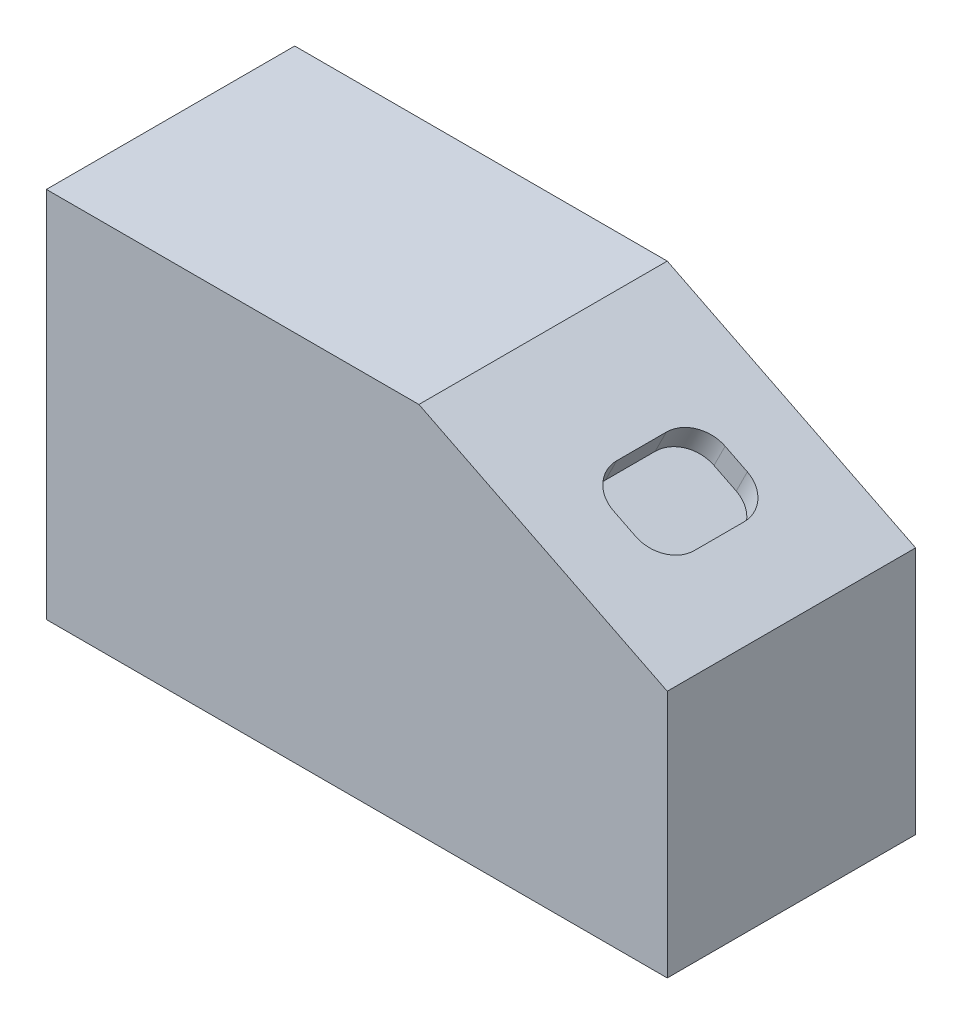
ISO-10303-21;
HEADER;
FILE_DESCRIPTION(('STEP AP214'),'2;1');
FILE_NAME('part.step','',(''),(''),'','','');
FILE_SCHEMA(('AUTOMOTIVE_DESIGN { 1 0 10303 214 1 1 1 1 }'));
ENDSEC;
DATA;
#1=APPLICATION_CONTEXT('core data for automotive mechanical design processes');
#2=APPLICATION_PROTOCOL_DEFINITION('international standard','automotive_design',2000,#1);
#3=PRODUCT_CONTEXT('',#1,'mechanical');
#4=PRODUCT('Part','Part','',(#3));
#5=PRODUCT_RELATED_PRODUCT_CATEGORY('part','',(#4));
#6=PRODUCT_DEFINITION_FORMATION('','',#4);
#7=PRODUCT_DEFINITION_CONTEXT('part definition',#1,'design');
#8=PRODUCT_DEFINITION('design','',#6,#7);
#9=PRODUCT_DEFINITION_SHAPE('','',#8);
#10=(LENGTH_UNIT() NAMED_UNIT(*) SI_UNIT(.MILLI.,.METRE.));
#11=(NAMED_UNIT(*) PLANE_ANGLE_UNIT() SI_UNIT($,.RADIAN.));
#12=(NAMED_UNIT(*) SI_UNIT($,.STERADIAN.) SOLID_ANGLE_UNIT());
#13=UNCERTAINTY_MEASURE_WITH_UNIT(LENGTH_MEASURE(1.E-05),#10,'distance_accuracy_value','');
#14=(GEOMETRIC_REPRESENTATION_CONTEXT(3) GLOBAL_UNCERTAINTY_ASSIGNED_CONTEXT((#13)) GLOBAL_UNIT_ASSIGNED_CONTEXT((#10,
#11,#12)) REPRESENTATION_CONTEXT('',''));
#15=CARTESIAN_POINT('',(0.,0.,0.));
#16=DIRECTION('',(0.,0.,1.));
#17=DIRECTION('',(1.,0.,0.));
#18=AXIS2_PLACEMENT_3D('',#15,#16,#17);
#19=CARTESIAN_POINT('',(0.,0.,-40.));
#20=DIRECTION('',(-1.,0.,0.));
#21=DIRECTION('',(0.,0.,1.));
#22=AXIS2_PLACEMENT_3D('',#19,#20,#21);
#23=PLANE('',#22);
#24=DIRECTION('',(0.,-1.,0.));
#25=VECTOR('',#24,1.);
#26=CARTESIAN_POINT('',(0.,0.,0.));
#27=LINE('',#26,#25);
#28=CARTESIAN_POINT('',(0.,60.,0.));
#29=VERTEX_POINT('',#28);
#30=CARTESIAN_POINT('',(0.,0.,0.));
#31=VERTEX_POINT('',#30);
#32=EDGE_CURVE('E161',#29,#31,#27,.T.);
#33=ORIENTED_EDGE('',*,*,#32,.F.);
#34=DIRECTION('',(0.,0.,1.));
#35=VECTOR('',#34,1.);
#36=CARTESIAN_POINT('',(0.,60.,-40.));
#37=LINE('',#36,#35);
#38=CARTESIAN_POINT('',(0.,60.,-40.));
#39=VERTEX_POINT('',#38);
#40=EDGE_CURVE('E171',#39,#29,#37,.T.);
#41=ORIENTED_EDGE('',*,*,#40,.F.);
#42=DIRECTION('',(0.,-1.,0.));
#43=VECTOR('',#42,1.);
#44=CARTESIAN_POINT('',(0.,0.,-40.));
#45=LINE('',#44,#43);
#46=CARTESIAN_POINT('',(0.,0.,-40.));
#47=VERTEX_POINT('',#46);
#48=EDGE_CURVE('E151',#39,#47,#45,.T.);
#49=ORIENTED_EDGE('',*,*,#48,.T.);
#50=DIRECTION('',(0.,0.,1.));
#51=VECTOR('',#50,1.);
#52=CARTESIAN_POINT('',(0.,0.,-40.));
#53=LINE('',#52,#51);
#54=EDGE_CURVE('E152',#47,#31,#53,.T.);
#55=ORIENTED_EDGE('',*,*,#54,.T.);
#56=EDGE_LOOP('',(#33,#41,#49,#55));
#57=FACE_BOUND('',#56,.T.);
#58=ADVANCED_FACE('F33',(#57),#23,.T.);
#59=CARTESIAN_POINT('',(0.,60.,-40.));
#60=DIRECTION('',(0.,1.,0.));
#61=DIRECTION('',(0.,0.,1.));
#62=AXIS2_PLACEMENT_3D('',#59,#60,#61);
#63=PLANE('',#62);
#64=DIRECTION('',(0.,0.,1.));
#65=VECTOR('',#64,1.);
#66=CARTESIAN_POINT('',(60.,60.,-40.));
#67=LINE('',#66,#65);
#68=CARTESIAN_POINT('',(60.,60.,-40.));
#69=VERTEX_POINT('',#68);
#70=CARTESIAN_POINT('',(60.,60.,0.));
#71=VERTEX_POINT('',#70);
#72=EDGE_CURVE('E129',#69,#71,#67,.T.);
#73=ORIENTED_EDGE('',*,*,#72,.F.);
#74=DIRECTION('',(-1.,0.,0.));
#75=VECTOR('',#74,1.);
#76=CARTESIAN_POINT('',(0.,60.,-40.));
#77=LINE('',#76,#75);
#78=EDGE_CURVE('E143',#69,#39,#77,.T.);
#79=ORIENTED_EDGE('',*,*,#78,.T.);
#80=ORIENTED_EDGE('',*,*,#40,.T.);
#81=DIRECTION('',(-1.,0.,0.));
#82=VECTOR('',#81,1.);
#83=CARTESIAN_POINT('',(0.,60.,0.));
#84=LINE('',#83,#82);
#85=EDGE_CURVE('E145',#71,#29,#84,.T.);
#86=ORIENTED_EDGE('',*,*,#85,.F.);
#87=EDGE_LOOP('',(#73,#79,#80,#86));
#88=FACE_BOUND('',#87,.T.);
#89=ADVANCED_FACE('F141',(#88),#63,.T.);
#90=CARTESIAN_POINT('',(100.,0.,-40.));
#91=DIRECTION('',(1.,0.,0.));
#92=DIRECTION('',(0.,0.,-1.));
#93=AXIS2_PLACEMENT_3D('',#90,#91,#92);
#94=PLANE('',#93);
#95=DIRECTION('',(0.,0.,1.));
#96=VECTOR('',#95,1.);
#97=CARTESIAN_POINT('',(100.,40.,-40.));
#98=LINE('',#97,#96);
#99=CARTESIAN_POINT('',(100.,40.,-40.));
#100=VERTEX_POINT('',#99);
#101=CARTESIAN_POINT('',(100.,40.,0.));
#102=VERTEX_POINT('',#101);
#103=EDGE_CURVE('E132',#100,#102,#98,.T.);
#104=ORIENTED_EDGE('',*,*,#103,.T.);
#105=DIRECTION('',(0.,1.,0.));
#106=VECTOR('',#105,1.);
#107=CARTESIAN_POINT('',(100.,0.,0.));
#108=LINE('',#107,#106);
#109=CARTESIAN_POINT('',(100.,0.,0.));
#110=VERTEX_POINT('',#109);
#111=EDGE_CURVE('E167',#110,#102,#108,.T.);
#112=ORIENTED_EDGE('',*,*,#111,.F.);
#113=DIRECTION('',(0.,0.,1.));
#114=VECTOR('',#113,1.);
#115=CARTESIAN_POINT('',(100.,0.,-40.));
#116=LINE('',#115,#114);
#117=CARTESIAN_POINT('',(100.,0.,-40.));
#118=VERTEX_POINT('',#117);
#119=EDGE_CURVE('E155',#118,#110,#116,.T.);
#120=ORIENTED_EDGE('',*,*,#119,.F.);
#121=DIRECTION('',(0.,1.,0.));
#122=VECTOR('',#121,1.);
#123=CARTESIAN_POINT('',(100.,0.,-40.));
#124=LINE('',#123,#122);
#125=EDGE_CURVE('E153',#118,#100,#124,.T.);
#126=ORIENTED_EDGE('',*,*,#125,.T.);
#127=EDGE_LOOP('',(#104,#112,#120,#126));
#128=FACE_BOUND('',#127,.T.);
#129=ADVANCED_FACE('F254',(#128),#94,.T.);
#130=CARTESIAN_POINT('',(0.,0.,-40.));
#131=DIRECTION('',(0.,-1.,0.));
#132=DIRECTION('',(0.,0.,-1.));
#133=AXIS2_PLACEMENT_3D('',#130,#131,#132);
#134=PLANE('',#133);
#135=DIRECTION('',(1.,0.,0.));
#136=VECTOR('',#135,1.);
#137=CARTESIAN_POINT('',(0.,0.,0.));
#138=LINE('',#137,#136);
#139=EDGE_CURVE('E164',#31,#110,#138,.T.);
#140=ORIENTED_EDGE('',*,*,#139,.F.);
#141=ORIENTED_EDGE('',*,*,#54,.F.);
#142=DIRECTION('',(1.,0.,0.));
#143=VECTOR('',#142,1.);
#144=CARTESIAN_POINT('',(0.,0.,-40.));
#145=LINE('',#144,#143);
#146=EDGE_CURVE('E157',#47,#118,#145,.T.);
#147=ORIENTED_EDGE('',*,*,#146,.T.);
#148=ORIENTED_EDGE('',*,*,#119,.T.);
#149=EDGE_LOOP('',(#140,#141,#147,#148));
#150=FACE_BOUND('',#149,.T.);
#151=ADVANCED_FACE('F247',(#150),#134,.T.);
#152=CARTESIAN_POINT('',(0.,0.,-40.));
#153=DIRECTION('',(0.,0.,-1.));
#154=DIRECTION('',(-1.,0.,0.));
#155=AXIS2_PLACEMENT_3D('',#152,#153,#154);
#156=PLANE('',#155);
#157=DIRECTION('',(0.894427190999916,-0.447213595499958,0.));
#158=VECTOR('',#157,1.);
#159=CARTESIAN_POINT('',(100.,40.,-40.));
#160=LINE('',#159,#158);
#161=EDGE_CURVE('E126',#69,#100,#160,.T.);
#162=ORIENTED_EDGE('',*,*,#161,.T.);
#163=ORIENTED_EDGE('',*,*,#125,.F.);
#164=ORIENTED_EDGE('',*,*,#146,.F.);
#165=ORIENTED_EDGE('',*,*,#48,.F.);
#166=ORIENTED_EDGE('',*,*,#78,.F.);
#167=EDGE_LOOP('',(#162,#163,#164,#165,#166));
#168=FACE_BOUND('',#167,.T.);
#169=ADVANCED_FACE('F148',(#168),#156,.T.);
#170=CARTESIAN_POINT('',(0.,0.,0.));
#171=DIRECTION('',(0.,0.,-1.));
#172=DIRECTION('',(-1.,0.,0.));
#173=AXIS2_PLACEMENT_3D('',#170,#171,#172);
#174=PLANE('',#173);
#175=ORIENTED_EDGE('',*,*,#111,.T.);
#176=DIRECTION('',(0.894427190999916,-0.447213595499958,0.));
#177=VECTOR('',#176,1.);
#178=CARTESIAN_POINT('',(100.,40.,0.));
#179=LINE('',#178,#177);
#180=EDGE_CURVE('E137',#71,#102,#179,.T.);
#181=ORIENTED_EDGE('',*,*,#180,.F.);
#182=ORIENTED_EDGE('',*,*,#85,.T.);
#183=ORIENTED_EDGE('',*,*,#32,.T.);
#184=ORIENTED_EDGE('',*,*,#139,.T.);
#185=EDGE_LOOP('',(#175,#181,#182,#183,#184));
#186=FACE_BOUND('',#185,.T.);
#187=ADVANCED_FACE('F252',(#186),#174,.F.);
#188=CARTESIAN_POINT('',(100.,40.,-40.));
#189=DIRECTION('',(-0.447213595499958,-0.894427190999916,0.));
#190=DIRECTION('',(0.894427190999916,-0.447213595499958,0.));
#191=AXIS2_PLACEMENT_3D('',#188,#189,#190);
#192=PLANE('',#191);
#193=DIRECTION('',(-0.894427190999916,0.447213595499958,0.));
#194=VECTOR('',#193,1.);
#195=CARTESIAN_POINT('',(75.8504658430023,52.0747670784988,-29.));
#196=LINE('',#195,#194);
#197=CARTESIAN_POINT('',(83.9003105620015,48.0498447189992,-29.));
#198=VERTEX_POINT('',#197);
#199=CARTESIAN_POINT('',(80.3226017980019,49.8386991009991,-29.));
#200=VERTEX_POINT('',#199);
#201=EDGE_CURVE('E207',#198,#200,#196,.T.);
#202=ORIENTED_EDGE('',*,*,#201,.F.);
#203=CARTESIAN_POINT('',(83.9003105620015,48.0498447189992,-24.));
#204=DIRECTION('',(-0.447213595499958,-0.894427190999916,0.));
#205=DIRECTION('',(0.894427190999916,-0.447213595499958,0.));
#206=AXIS2_PLACEMENT_3D('',#203,#204,#205);
#207=CIRCLE('',#206,5.);
#208=CARTESIAN_POINT('',(88.3724465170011,45.8137767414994,-24.));
#209=VERTEX_POINT('',#208);
#210=EDGE_CURVE('E41',#198,#209,#207,.T.);
#211=ORIENTED_EDGE('',*,*,#210,.T.);
#212=DIRECTION('',(0.,0.,-1.));
#213=VECTOR('',#212,1.);
#214=CARTESIAN_POINT('',(88.3724465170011,45.8137767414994,-11.));
#215=LINE('',#214,#213);
#216=CARTESIAN_POINT('',(88.3724465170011,45.8137767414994,-16.));
#217=VERTEX_POINT('',#216);
#218=EDGE_CURVE('E206',#217,#209,#215,.T.);
#219=ORIENTED_EDGE('',*,*,#218,.F.);
#220=CARTESIAN_POINT('',(83.9003105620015,48.0498447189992,-16.));
#221=DIRECTION('',(-0.447213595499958,-0.894427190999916,0.));
#222=DIRECTION('',(0.894427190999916,-0.447213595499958,0.));
#223=AXIS2_PLACEMENT_3D('',#220,#221,#222);
#224=CIRCLE('',#223,5.);
#225=CARTESIAN_POINT('',(83.9003105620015,48.0498447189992,-11.));
#226=VERTEX_POINT('',#225);
#227=EDGE_CURVE('E203',#217,#226,#224,.T.);
#228=ORIENTED_EDGE('',*,*,#227,.T.);
#229=DIRECTION('',(0.894427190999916,-0.447213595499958,0.));
#230=VECTOR('',#229,1.);
#231=CARTESIAN_POINT('',(75.8504658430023,52.0747670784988,-11.));
#232=LINE('',#231,#230);
#233=CARTESIAN_POINT('',(80.3226017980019,49.8386991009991,-11.));
#234=VERTEX_POINT('',#233);
#235=EDGE_CURVE('E231',#234,#226,#232,.T.);
#236=ORIENTED_EDGE('',*,*,#235,.F.);
#237=CARTESIAN_POINT('',(80.3226017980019,49.8386991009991,-16.));
#238=DIRECTION('',(-0.447213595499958,-0.894427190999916,0.));
#239=DIRECTION('',(0.894427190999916,-0.447213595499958,0.));
#240=AXIS2_PLACEMENT_3D('',#237,#238,#239);
#241=CIRCLE('',#240,5.);
#242=CARTESIAN_POINT('',(75.8504658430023,52.0747670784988,-16.));
#243=VERTEX_POINT('',#242);
#244=EDGE_CURVE('E201',#234,#243,#241,.T.);
#245=ORIENTED_EDGE('',*,*,#244,.T.);
#246=DIRECTION('',(0.,0.,1.));
#247=VECTOR('',#246,1.);
#248=CARTESIAN_POINT('',(75.8504658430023,52.0747670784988,-11.));
#249=LINE('',#248,#247);
#250=CARTESIAN_POINT('',(75.8504658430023,52.0747670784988,-24.));
#251=VERTEX_POINT('',#250);
#252=EDGE_CURVE('E237',#251,#243,#249,.T.);
#253=ORIENTED_EDGE('',*,*,#252,.F.);
#254=CARTESIAN_POINT('',(80.3226017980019,49.8386991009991,-24.));
#255=DIRECTION('',(-0.447213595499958,-0.894427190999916,0.));
#256=DIRECTION('',(0.894427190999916,-0.447213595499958,0.));
#257=AXIS2_PLACEMENT_3D('',#254,#255,#256);
#258=CIRCLE('',#257,5.);
#259=EDGE_CURVE('E11',#251,#200,#258,.T.);
#260=ORIENTED_EDGE('',*,*,#259,.T.);
#261=EDGE_LOOP('',(#202,#211,#219,#228,#236,#245,#253,#260));
#262=FACE_BOUND('',#261,.T.);
#263=ORIENTED_EDGE('',*,*,#180,.T.);
#264=ORIENTED_EDGE('',*,*,#103,.F.);
#265=ORIENTED_EDGE('',*,*,#161,.F.);
#266=ORIENTED_EDGE('',*,*,#72,.T.);
#267=EDGE_LOOP('',(#263,#264,#265,#266));
#268=FACE_BOUND('',#267,.T.);
#269=ADVANCED_FACE('F128',(#262,#268),#192,.F.);
#270=CARTESIAN_POINT('',(86.5835921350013,42.2360679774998,-11.));
#271=DIRECTION('',(0.894427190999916,-0.447213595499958,0.));
#272=DIRECTION('',(0.447213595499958,0.894427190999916,0.));
#273=AXIS2_PLACEMENT_3D('',#270,#271,#272);
#274=PLANE('',#273);
#275=DIRECTION('',(0.,0.,-1.));
#276=VECTOR('',#275,1.);
#277=CARTESIAN_POINT('',(86.5835921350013,42.2360679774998,-11.));
#278=LINE('',#277,#276);
#279=CARTESIAN_POINT('',(86.5835921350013,42.2360679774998,-16.));
#280=VERTEX_POINT('',#279);
#281=CARTESIAN_POINT('',(86.5835921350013,42.2360679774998,-24.));
#282=VERTEX_POINT('',#281);
#283=EDGE_CURVE('E223',#280,#282,#278,.T.);
#284=ORIENTED_EDGE('',*,*,#283,.F.);
#285=DIRECTION('',(0.447213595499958,0.894427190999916,0.));
#286=VECTOR('',#285,1.);
#287=CARTESIAN_POINT('',(88.3724465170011,45.8137767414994,-16.));
#288=LINE('',#287,#286);
#289=EDGE_CURVE('E194',#280,#217,#288,.T.);
#290=ORIENTED_EDGE('',*,*,#289,.T.);
#291=ORIENTED_EDGE('',*,*,#218,.T.);
#292=DIRECTION('',(0.447213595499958,0.894427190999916,0.));
#293=VECTOR('',#292,1.);
#294=CARTESIAN_POINT('',(86.5835921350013,42.2360679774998,-24.));
#295=LINE('',#294,#293);
#296=EDGE_CURVE('E192',#209,#282,#295,.F.);
#297=ORIENTED_EDGE('',*,*,#296,.T.);
#298=EDGE_LOOP('',(#284,#290,#291,#297));
#299=FACE_BOUND('',#298,.T.);
#300=ADVANCED_FACE('F210',(#299),#274,.F.);
#301=CARTESIAN_POINT('',(74.0616114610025,48.4970583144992,-11.));
#302=DIRECTION('',(0.,0.,1.));
#303=DIRECTION('',(1.,0.,0.));
#304=AXIS2_PLACEMENT_3D('',#301,#302,#303);
#305=PLANE('',#304);
#306=DIRECTION('',(0.894427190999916,-0.447213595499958,0.));
#307=VECTOR('',#306,1.);
#308=CARTESIAN_POINT('',(74.0616114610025,48.4970583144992,-11.));
#309=LINE('',#308,#307);
#310=CARTESIAN_POINT('',(78.533747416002,46.2609903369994,-11.));
#311=VERTEX_POINT('',#310);
#312=CARTESIAN_POINT('',(82.1114561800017,44.4721359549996,-11.));
#313=VERTEX_POINT('',#312);
#314=EDGE_CURVE('E229',#311,#313,#309,.T.);
#315=ORIENTED_EDGE('',*,*,#314,.F.);
#316=DIRECTION('',(0.447213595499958,0.894427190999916,0.));
#317=VECTOR('',#316,1.);
#318=CARTESIAN_POINT('',(80.3226017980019,49.8386991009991,-11.));
#319=LINE('',#318,#317);
#320=EDGE_CURVE('E176',#311,#234,#319,.T.);
#321=ORIENTED_EDGE('',*,*,#320,.T.);
#322=ORIENTED_EDGE('',*,*,#235,.T.);
#323=DIRECTION('',(0.447213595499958,0.894427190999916,0.));
#324=VECTOR('',#323,1.);
#325=CARTESIAN_POINT('',(82.1114561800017,44.4721359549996,-11.));
#326=LINE('',#325,#324);
#327=EDGE_CURVE('E173',#226,#313,#326,.F.);
#328=ORIENTED_EDGE('',*,*,#327,.T.);
#329=EDGE_LOOP('',(#315,#321,#322,#328));
#330=FACE_BOUND('',#329,.T.);
#331=ADVANCED_FACE('F292',(#330),#305,.F.);
#332=CARTESIAN_POINT('',(74.0616114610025,48.4970583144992,-11.));
#333=DIRECTION('',(-0.894427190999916,0.447213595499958,0.));
#334=DIRECTION('',(-0.447213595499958,-0.894427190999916,0.));
#335=AXIS2_PLACEMENT_3D('',#332,#333,#334);
#336=PLANE('',#335);
#337=ORIENTED_EDGE('',*,*,#252,.T.);
#338=DIRECTION('',(0.447213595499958,0.894427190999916,0.));
#339=VECTOR('',#338,1.);
#340=CARTESIAN_POINT('',(74.0616114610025,48.4970583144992,-16.));
#341=LINE('',#340,#339);
#342=CARTESIAN_POINT('',(74.0616114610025,48.4970583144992,-16.));
#343=VERTEX_POINT('',#342);
#344=EDGE_CURVE('E182',#243,#343,#341,.F.);
#345=ORIENTED_EDGE('',*,*,#344,.T.);
#346=DIRECTION('',(0.,0.,1.));
#347=VECTOR('',#346,1.);
#348=CARTESIAN_POINT('',(74.0616114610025,48.4970583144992,-11.));
#349=LINE('',#348,#347);
#350=CARTESIAN_POINT('',(74.0616114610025,48.4970583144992,-24.));
#351=VERTEX_POINT('',#350);
#352=EDGE_CURVE('E227',#351,#343,#349,.T.);
#353=ORIENTED_EDGE('',*,*,#352,.F.);
#354=DIRECTION('',(0.447213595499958,0.894427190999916,0.));
#355=VECTOR('',#354,1.);
#356=CARTESIAN_POINT('',(75.8504658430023,52.0747670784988,-24.));
#357=LINE('',#356,#355);
#358=EDGE_CURVE('E179',#351,#251,#357,.T.);
#359=ORIENTED_EDGE('',*,*,#358,.T.);
#360=EDGE_LOOP('',(#337,#345,#353,#359));
#361=FACE_BOUND('',#360,.T.);
#362=ADVANCED_FACE('F286',(#361),#336,.F.);
#363=CARTESIAN_POINT('',(74.0616114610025,48.4970583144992,-29.));
#364=DIRECTION('',(0.,0.,-1.));
#365=DIRECTION('',(-1.,0.,0.));
#366=AXIS2_PLACEMENT_3D('',#363,#364,#365);
#367=PLANE('',#366);
#368=DIRECTION('',(-0.894427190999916,0.447213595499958,0.));
#369=VECTOR('',#368,1.);
#370=CARTESIAN_POINT('',(74.0616114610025,48.4970583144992,-29.));
#371=LINE('',#370,#369);
#372=CARTESIAN_POINT('',(82.1114561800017,44.4721359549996,-29.));
#373=VERTEX_POINT('',#372);
#374=CARTESIAN_POINT('',(78.533747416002,46.2609903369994,-29.));
#375=VERTEX_POINT('',#374);
#376=EDGE_CURVE('E221',#373,#375,#371,.T.);
#377=ORIENTED_EDGE('',*,*,#376,.F.);
#378=DIRECTION('',(0.447213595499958,0.894427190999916,0.));
#379=VECTOR('',#378,1.);
#380=CARTESIAN_POINT('',(83.9003105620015,48.0498447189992,-29.));
#381=LINE('',#380,#379);
#382=EDGE_CURVE('E199',#373,#198,#381,.T.);
#383=ORIENTED_EDGE('',*,*,#382,.T.);
#384=ORIENTED_EDGE('',*,*,#201,.T.);
#385=DIRECTION('',(0.447213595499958,0.894427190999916,0.));
#386=VECTOR('',#385,1.);
#387=CARTESIAN_POINT('',(78.533747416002,46.2609903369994,-29.));
#388=LINE('',#387,#386);
#389=EDGE_CURVE('E197',#200,#375,#388,.F.);
#390=ORIENTED_EDGE('',*,*,#389,.T.);
#391=EDGE_LOOP('',(#377,#383,#384,#390));
#392=FACE_BOUND('',#391,.T.);
#393=ADVANCED_FACE('F225',(#392),#367,.F.);
#394=CARTESIAN_POINT('',(34.2111456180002,68.4222912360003,0.));
#395=DIRECTION('',(-0.447213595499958,-0.894427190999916,0.));
#396=DIRECTION('',(0.894427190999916,-0.447213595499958,0.));
#397=AXIS2_PLACEMENT_3D('',#394,#395,#396);
#398=PLANE('',#397);
#399=ORIENTED_EDGE('',*,*,#352,.T.);
#400=CARTESIAN_POINT('',(78.533747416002,46.2609903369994,-16.));
#401=DIRECTION('',(-0.447213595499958,-0.894427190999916,0.));
#402=DIRECTION('',(0.894427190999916,-0.447213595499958,0.));
#403=AXIS2_PLACEMENT_3D('',#400,#401,#402);
#404=CIRCLE('',#403,5.);
#405=EDGE_CURVE('E190',#343,#311,#404,.F.);
#406=ORIENTED_EDGE('',*,*,#405,.T.);
#407=ORIENTED_EDGE('',*,*,#314,.T.);
#408=CARTESIAN_POINT('',(82.1114561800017,44.4721359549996,-16.));
#409=DIRECTION('',(-0.447213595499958,-0.894427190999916,0.));
#410=DIRECTION('',(0.894427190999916,-0.447213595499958,0.));
#411=AXIS2_PLACEMENT_3D('',#408,#409,#410);
#412=CIRCLE('',#411,5.);
#413=EDGE_CURVE('E188',#313,#280,#412,.F.);
#414=ORIENTED_EDGE('',*,*,#413,.T.);
#415=ORIENTED_EDGE('',*,*,#283,.T.);
#416=CARTESIAN_POINT('',(82.1114561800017,44.4721359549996,-24.));
#417=DIRECTION('',(-0.447213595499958,-0.894427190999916,0.));
#418=DIRECTION('',(0.894427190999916,-0.447213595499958,0.));
#419=AXIS2_PLACEMENT_3D('',#416,#417,#418);
#420=CIRCLE('',#419,5.);
#421=EDGE_CURVE('E186',#282,#373,#420,.F.);
#422=ORIENTED_EDGE('',*,*,#421,.T.);
#423=ORIENTED_EDGE('',*,*,#376,.T.);
#424=CARTESIAN_POINT('',(78.533747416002,46.2609903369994,-24.));
#425=DIRECTION('',(-0.447213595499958,-0.894427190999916,0.));
#426=DIRECTION('',(0.894427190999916,-0.447213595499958,0.));
#427=AXIS2_PLACEMENT_3D('',#424,#425,#426);
#428=CIRCLE('',#427,5.);
#429=EDGE_CURVE('E184',#375,#351,#428,.F.);
#430=ORIENTED_EDGE('',*,*,#429,.T.);
#431=EDGE_LOOP('',(#399,#406,#407,#414,#415,#422,#423,#430));
#432=FACE_BOUND('',#431,.T.);
#433=ADVANCED_FACE('F220',(#432),#398,.F.);
#434=CARTESIAN_POINT('',(78.533747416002,46.2609903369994,-16.));
#435=DIRECTION('',(-0.447213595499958,-0.894427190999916,0.));
#436=DIRECTION('',(0.894427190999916,-0.447213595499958,0.));
#437=AXIS2_PLACEMENT_3D('',#434,#435,#436);
#438=CYLINDRICAL_SURFACE('',#437,5.);
#439=ORIENTED_EDGE('',*,*,#405,.F.);
#440=ORIENTED_EDGE('',*,*,#344,.F.);
#441=ORIENTED_EDGE('',*,*,#244,.F.);
#442=ORIENTED_EDGE('',*,*,#320,.F.);
#443=EDGE_LOOP('',(#439,#440,#441,#442));
#444=FACE_BOUND('',#443,.T.);
#445=ADVANCED_FACE('F268',(#444),#438,.F.);
#446=CARTESIAN_POINT('',(82.1114561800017,44.4721359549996,-16.));
#447=DIRECTION('',(-0.447213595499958,-0.894427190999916,0.));
#448=DIRECTION('',(0.894427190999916,-0.447213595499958,0.));
#449=AXIS2_PLACEMENT_3D('',#446,#447,#448);
#450=CYLINDRICAL_SURFACE('',#449,5.);
#451=ORIENTED_EDGE('',*,*,#413,.F.);
#452=ORIENTED_EDGE('',*,*,#327,.F.);
#453=ORIENTED_EDGE('',*,*,#227,.F.);
#454=ORIENTED_EDGE('',*,*,#289,.F.);
#455=EDGE_LOOP('',(#451,#452,#453,#454));
#456=FACE_BOUND('',#455,.T.);
#457=ADVANCED_FACE('F271',(#456),#450,.F.);
#458=CARTESIAN_POINT('',(82.1114561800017,44.4721359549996,-24.));
#459=DIRECTION('',(-0.447213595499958,-0.894427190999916,0.));
#460=DIRECTION('',(0.894427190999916,-0.447213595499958,0.));
#461=AXIS2_PLACEMENT_3D('',#458,#459,#460);
#462=CYLINDRICAL_SURFACE('',#461,5.);
#463=ORIENTED_EDGE('',*,*,#421,.F.);
#464=ORIENTED_EDGE('',*,*,#296,.F.);
#465=ORIENTED_EDGE('',*,*,#210,.F.);
#466=ORIENTED_EDGE('',*,*,#382,.F.);
#467=EDGE_LOOP('',(#463,#464,#465,#466));
#468=FACE_BOUND('',#467,.T.);
#469=ADVANCED_FACE('F215',(#468),#462,.F.);
#470=CARTESIAN_POINT('',(78.533747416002,46.2609903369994,-24.));
#471=DIRECTION('',(-0.447213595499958,-0.894427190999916,0.));
#472=DIRECTION('',(0.894427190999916,-0.447213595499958,0.));
#473=AXIS2_PLACEMENT_3D('',#470,#471,#472);
#474=CYLINDRICAL_SURFACE('',#473,5.);
#475=ORIENTED_EDGE('',*,*,#429,.F.);
#476=ORIENTED_EDGE('',*,*,#389,.F.);
#477=ORIENTED_EDGE('',*,*,#259,.F.);
#478=ORIENTED_EDGE('',*,*,#358,.F.);
#479=EDGE_LOOP('',(#475,#476,#477,#478));
#480=FACE_BOUND('',#479,.T.);
#481=ADVANCED_FACE('F35',(#480),#474,.F.);
#482=CLOSED_SHELL('',(#58,#89,#129,#151,#169,#187,#269,#300,#331,#362,#393,#433,#445,#457,#469,#481));
#483=MANIFOLD_SOLID_BREP('B2',#482);
#484=ADVANCED_BREP_SHAPE_REPRESENTATION('',(#18,#483),#14);
#485=SHAPE_DEFINITION_REPRESENTATION(#9,#484);
ENDSEC;
END-ISO-10303-21;
